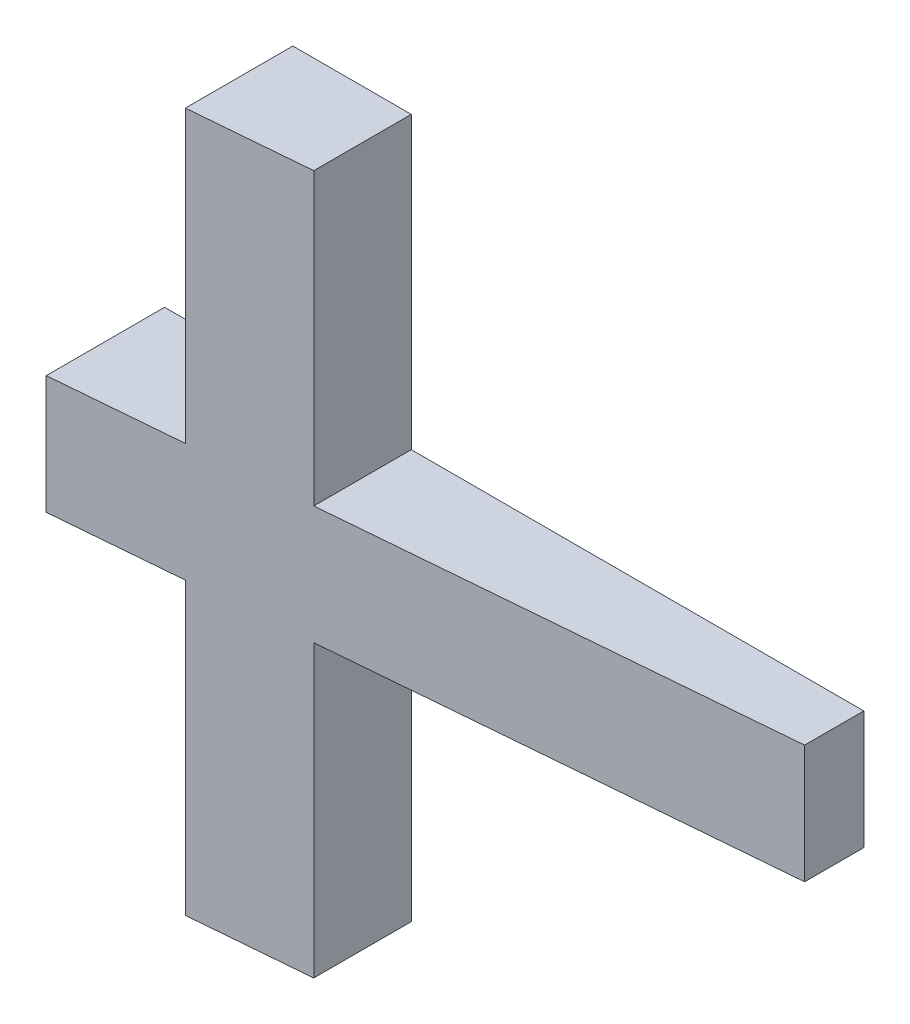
from build123d import *

# Parameters (mm, degrees)
BOSS_EXTRUDE1_DEPTH     = 609.6
CUT_EXTRUDE1_DEPTH      = 3249.658677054
CUT_EXTRUDE1_DEPTH_BACK = 3249.658677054


with BuildPart() as part:
    # Sketch1 → Boss-Extrude1 (new body)
    with BuildSketch(Plane(origin=(0, 0, 0), x_dir=(0, 1, 0), z_dir=(0, 0, 1))):
        Polygon((-304.8, 965.2), (304.8, 965.2), (304.8, 304.8), (1800, 304.8), (1800, -304.8), (304.8, -304.8), (304.8, -2634.8), (-304.8, -2634.8), (-304.8, -304.8), (-1800, -304.8), (-1800, 304.8), (-304.8, 304.8), align=None)
    extrude(amount=BOSS_EXTRUDE1_DEPTH)

    # Sketch2 → Cut-Extrude1 (cut, two sides: drawn at the far end of the back side and taken through both)
    with BuildSketch(Plane(origin=(0, 0, 0), x_dir=(-1, 0, 0), z_dir=(0, 1, 0)).offset(-CUT_EXTRUDE1_DEPTH_BACK)):
        Polygon((965.2, 609.6), (-2634.8, 304.8), (-2634.8, 1077.306378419), align=None)
    extrude(amount=CUT_EXTRUDE1_DEPTH + CUT_EXTRUDE1_DEPTH_BACK, mode=Mode.SUBTRACT)


solid = part.part
